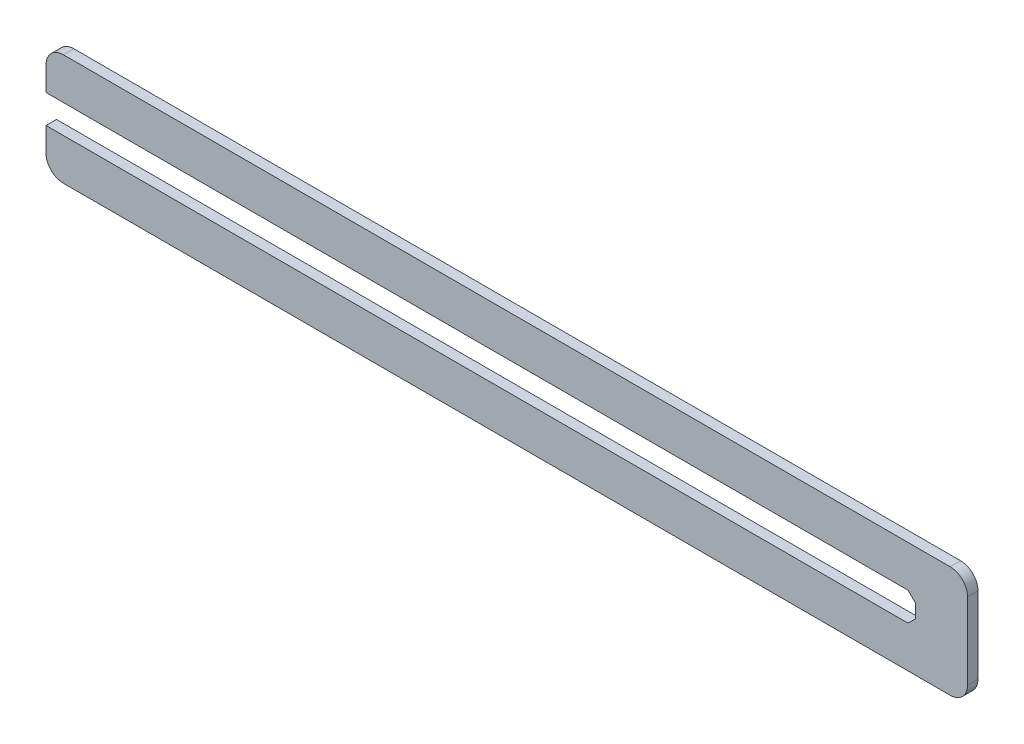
ISO-10303-21;
HEADER;
FILE_DESCRIPTION(('STEP AP214'),'2;1');
FILE_NAME('part.step','',(''),(''),'','','');
FILE_SCHEMA(('AUTOMOTIVE_DESIGN { 1 0 10303 214 1 1 1 1 }'));
ENDSEC;
DATA;
#1=APPLICATION_CONTEXT('core data for automotive mechanical design processes');
#2=APPLICATION_PROTOCOL_DEFINITION('international standard','automotive_design',2000,#1);
#3=PRODUCT_CONTEXT('',#1,'mechanical');
#4=PRODUCT('Part','Part','',(#3));
#5=PRODUCT_RELATED_PRODUCT_CATEGORY('part','',(#4));
#6=PRODUCT_DEFINITION_FORMATION('','',#4);
#7=PRODUCT_DEFINITION_CONTEXT('part definition',#1,'design');
#8=PRODUCT_DEFINITION('design','',#6,#7);
#9=PRODUCT_DEFINITION_SHAPE('','',#8);
#10=(LENGTH_UNIT() NAMED_UNIT(*) SI_UNIT(.MILLI.,.METRE.));
#11=(NAMED_UNIT(*) PLANE_ANGLE_UNIT() SI_UNIT($,.RADIAN.));
#12=(NAMED_UNIT(*) SI_UNIT($,.STERADIAN.) SOLID_ANGLE_UNIT());
#13=UNCERTAINTY_MEASURE_WITH_UNIT(LENGTH_MEASURE(1.E-05),#10,'distance_accuracy_value','');
#14=(GEOMETRIC_REPRESENTATION_CONTEXT(3) GLOBAL_UNCERTAINTY_ASSIGNED_CONTEXT((#13)) GLOBAL_UNIT_ASSIGNED_CONTEXT((#10,
#11,#12)) REPRESENTATION_CONTEXT('',''));
#15=CARTESIAN_POINT('',(0.,0.,0.));
#16=DIRECTION('',(0.,0.,1.));
#17=DIRECTION('',(1.,0.,0.));
#18=AXIS2_PLACEMENT_3D('',#15,#16,#17);
#19=CARTESIAN_POINT('',(0.,0.,3.));
#20=DIRECTION('',(1.,0.,0.));
#21=DIRECTION('',(0.,0.,-1.));
#22=AXIS2_PLACEMENT_3D('',#19,#20,#21);
#23=PLANE('',#22);
#24=DIRECTION('',(0.,-1.,0.));
#25=VECTOR('',#24,1.);
#26=CARTESIAN_POINT('',(0.,0.,3.));
#27=LINE('',#26,#25);
#28=CARTESIAN_POINT('',(0.,27.,3.));
#29=VERTEX_POINT('',#28);
#30=CARTESIAN_POINT('',(0.,20.1,3.));
#31=VERTEX_POINT('',#30);
#32=EDGE_CURVE('E224',#29,#31,#27,.T.);
#33=ORIENTED_EDGE('',*,*,#32,.F.);
#34=DIRECTION('',(0.,0.,-1.));
#35=VECTOR('',#34,1.);
#36=CARTESIAN_POINT('',(0.,27.,3.));
#37=LINE('',#36,#35);
#38=CARTESIAN_POINT('',(0.,27.,0.));
#39=VERTEX_POINT('',#38);
#40=EDGE_CURVE('E178',#29,#39,#37,.T.);
#41=ORIENTED_EDGE('',*,*,#40,.T.);
#42=DIRECTION('',(0.,-1.,0.));
#43=VECTOR('',#42,1.);
#44=CARTESIAN_POINT('',(0.,0.,0.));
#45=LINE('',#44,#43);
#46=CARTESIAN_POINT('',(0.,20.1,0.));
#47=VERTEX_POINT('',#46);
#48=EDGE_CURVE('E160',#39,#47,#45,.T.);
#49=ORIENTED_EDGE('',*,*,#48,.T.);
#50=DIRECTION('',(0.,0.,1.));
#51=VECTOR('',#50,1.);
#52=CARTESIAN_POINT('',(0.,20.1,0.));
#53=LINE('',#52,#51);
#54=EDGE_CURVE('E161',#47,#31,#53,.T.);
#55=ORIENTED_EDGE('',*,*,#54,.T.);
#56=EDGE_LOOP('',(#33,#41,#49,#55));
#57=FACE_BOUND('',#56,.T.);
#58=ADVANCED_FACE('F32',(#57),#23,.F.);
#59=CARTESIAN_POINT('',(0.,11.9,0.));
#60=VERTEX_POINT('',#59);
#61=CARTESIAN_POINT('',(0.,5.,0.));
#62=VERTEX_POINT('',#61);
#63=EDGE_CURVE('E150',#60,#62,#45,.T.);
#64=ORIENTED_EDGE('',*,*,#63,.T.);
#65=DIRECTION('',(0.,0.,-1.));
#66=VECTOR('',#65,1.);
#67=CARTESIAN_POINT('',(0.,5.,3.));
#68=LINE('',#67,#66);
#69=CARTESIAN_POINT('',(0.,5.,3.));
#70=VERTEX_POINT('',#69);
#71=EDGE_CURVE('E205',#62,#70,#68,.F.);
#72=ORIENTED_EDGE('',*,*,#71,.T.);
#73=CARTESIAN_POINT('',(0.,11.9,3.));
#74=VERTEX_POINT('',#73);
#75=EDGE_CURVE('E153',#74,#70,#27,.T.);
#76=ORIENTED_EDGE('',*,*,#75,.F.);
#77=DIRECTION('',(0.,0.,1.));
#78=VECTOR('',#77,1.);
#79=CARTESIAN_POINT('',(0.,11.9,0.));
#80=LINE('',#79,#78);
#81=EDGE_CURVE('E137',#60,#74,#80,.T.);
#82=ORIENTED_EDGE('',*,*,#81,.F.);
#83=EDGE_LOOP('',(#64,#72,#76,#82));
#84=FACE_BOUND('',#83,.T.);
#85=ADVANCED_FACE('F149',(#84),#23,.F.);
#86=CARTESIAN_POINT('',(0.,0.,3.));
#87=DIRECTION('',(0.,1.,0.));
#88=DIRECTION('',(0.,0.,1.));
#89=AXIS2_PLACEMENT_3D('',#86,#87,#88);
#90=PLANE('',#89);
#91=DIRECTION('',(1.,0.,0.));
#92=VECTOR('',#91,1.);
#93=CARTESIAN_POINT('',(0.,0.,3.));
#94=LINE('',#93,#92);
#95=CARTESIAN_POINT('',(5.,0.,3.));
#96=VERTEX_POINT('',#95);
#97=CARTESIAN_POINT('',(260.,0.,3.));
#98=VERTEX_POINT('',#97);
#99=EDGE_CURVE('E223',#96,#98,#94,.T.);
#100=ORIENTED_EDGE('',*,*,#99,.F.);
#101=DIRECTION('',(0.,0.,-1.));
#102=VECTOR('',#101,1.);
#103=CARTESIAN_POINT('',(5.,0.,3.));
#104=LINE('',#103,#102);
#105=CARTESIAN_POINT('',(5.,0.,0.));
#106=VERTEX_POINT('',#105);
#107=EDGE_CURVE('E202',#96,#106,#104,.T.);
#108=ORIENTED_EDGE('',*,*,#107,.T.);
#109=DIRECTION('',(1.,0.,0.));
#110=VECTOR('',#109,1.);
#111=CARTESIAN_POINT('',(0.,0.,0.));
#112=LINE('',#111,#110);
#113=CARTESIAN_POINT('',(260.,0.,0.));
#114=VERTEX_POINT('',#113);
#115=EDGE_CURVE('E163',#106,#114,#112,.T.);
#116=ORIENTED_EDGE('',*,*,#115,.T.);
#117=DIRECTION('',(0.,0.,-1.));
#118=VECTOR('',#117,1.);
#119=CARTESIAN_POINT('',(260.,0.,3.));
#120=LINE('',#119,#118);
#121=EDGE_CURVE('E200',#114,#98,#120,.F.);
#122=ORIENTED_EDGE('',*,*,#121,.T.);
#123=EDGE_LOOP('',(#100,#108,#116,#122));
#124=FACE_BOUND('',#123,.T.);
#125=ADVANCED_FACE('F283',(#124),#90,.F.);
#126=CARTESIAN_POINT('',(265.,0.,3.));
#127=DIRECTION('',(-1.,0.,0.));
#128=DIRECTION('',(0.,0.,1.));
#129=AXIS2_PLACEMENT_3D('',#126,#127,#128);
#130=PLANE('',#129);
#131=DIRECTION('',(0.,1.,0.));
#132=VECTOR('',#131,1.);
#133=CARTESIAN_POINT('',(265.,0.,0.));
#134=LINE('',#133,#132);
#135=CARTESIAN_POINT('',(265.,5.,0.));
#136=VERTEX_POINT('',#135);
#137=CARTESIAN_POINT('',(265.,27.,0.));
#138=VERTEX_POINT('',#137);
#139=EDGE_CURVE('E173',#136,#138,#134,.T.);
#140=ORIENTED_EDGE('',*,*,#139,.T.);
#141=DIRECTION('',(0.,0.,-1.));
#142=VECTOR('',#141,1.);
#143=CARTESIAN_POINT('',(265.,27.,3.));
#144=LINE('',#143,#142);
#145=CARTESIAN_POINT('',(265.,27.,3.));
#146=VERTEX_POINT('',#145);
#147=EDGE_CURVE('E11',#138,#146,#144,.F.);
#148=ORIENTED_EDGE('',*,*,#147,.T.);
#149=DIRECTION('',(0.,1.,0.));
#150=VECTOR('',#149,1.);
#151=CARTESIAN_POINT('',(265.,0.,3.));
#152=LINE('',#151,#150);
#153=CARTESIAN_POINT('',(265.,5.,3.));
#154=VERTEX_POINT('',#153);
#155=EDGE_CURVE('E210',#154,#146,#152,.T.);
#156=ORIENTED_EDGE('',*,*,#155,.F.);
#157=DIRECTION('',(0.,0.,-1.));
#158=VECTOR('',#157,1.);
#159=CARTESIAN_POINT('',(265.,5.,3.));
#160=LINE('',#159,#158);
#161=EDGE_CURVE('E40',#154,#136,#160,.T.);
#162=ORIENTED_EDGE('',*,*,#161,.T.);
#163=EDGE_LOOP('',(#140,#148,#156,#162));
#164=FACE_BOUND('',#163,.T.);
#165=ADVANCED_FACE('F209',(#164),#130,.F.);
#166=CARTESIAN_POINT('',(0.,32.,3.));
#167=DIRECTION('',(0.,-1.,0.));
#168=DIRECTION('',(0.,0.,-1.));
#169=AXIS2_PLACEMENT_3D('',#166,#167,#168);
#170=PLANE('',#169);
#171=DIRECTION('',(-1.,0.,0.));
#172=VECTOR('',#171,1.);
#173=CARTESIAN_POINT('',(0.,32.,0.));
#174=LINE('',#173,#172);
#175=CARTESIAN_POINT('',(260.,32.,0.));
#176=VERTEX_POINT('',#175);
#177=CARTESIAN_POINT('',(5.,32.,0.));
#178=VERTEX_POINT('',#177);
#179=EDGE_CURVE('E175',#176,#178,#174,.T.);
#180=ORIENTED_EDGE('',*,*,#179,.T.);
#181=DIRECTION('',(0.,0.,-1.));
#182=VECTOR('',#181,1.);
#183=CARTESIAN_POINT('',(5.,32.,3.));
#184=LINE('',#183,#182);
#185=CARTESIAN_POINT('',(5.,32.,3.));
#186=VERTEX_POINT('',#185);
#187=EDGE_CURVE('E191',#178,#186,#184,.F.);
#188=ORIENTED_EDGE('',*,*,#187,.T.);
#189=DIRECTION('',(-1.,0.,0.));
#190=VECTOR('',#189,1.);
#191=CARTESIAN_POINT('',(0.,32.,3.));
#192=LINE('',#191,#190);
#193=CARTESIAN_POINT('',(260.,32.,3.));
#194=VERTEX_POINT('',#193);
#195=EDGE_CURVE('E169',#194,#186,#192,.T.);
#196=ORIENTED_EDGE('',*,*,#195,.F.);
#197=DIRECTION('',(0.,0.,-1.));
#198=VECTOR('',#197,1.);
#199=CARTESIAN_POINT('',(260.,32.,3.));
#200=LINE('',#199,#198);
#201=EDGE_CURVE('E188',#194,#176,#200,.T.);
#202=ORIENTED_EDGE('',*,*,#201,.T.);
#203=EDGE_LOOP('',(#180,#188,#196,#202));
#204=FACE_BOUND('',#203,.T.);
#205=ADVANCED_FACE('F219',(#204),#170,.F.);
#206=CARTESIAN_POINT('',(0.,32.,3.));
#207=DIRECTION('',(0.,0.,-1.));
#208=DIRECTION('',(-1.,0.,0.));
#209=AXIS2_PLACEMENT_3D('',#206,#207,#208);
#210=PLANE('',#209);
#211=ORIENTED_EDGE('',*,*,#195,.T.);
#212=CARTESIAN_POINT('',(5.,27.,3.));
#213=DIRECTION('',(0.,0.,-1.));
#214=DIRECTION('',(-1.,0.,0.));
#215=AXIS2_PLACEMENT_3D('',#212,#213,#214);
#216=CIRCLE('',#215,5.);
#217=EDGE_CURVE('E198',#186,#29,#216,.F.);
#218=ORIENTED_EDGE('',*,*,#217,.T.);
#219=ORIENTED_EDGE('',*,*,#32,.T.);
#220=DIRECTION('',(-1.,0.,0.));
#221=VECTOR('',#220,1.);
#222=CARTESIAN_POINT('',(0.,20.1,3.));
#223=LINE('',#222,#221);
#224=CARTESIAN_POINT('',(247.87867965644,20.1,3.));
#225=VERTEX_POINT('',#224);
#226=EDGE_CURVE('E144',#225,#31,#223,.T.);
#227=ORIENTED_EDGE('',*,*,#226,.F.);
#228=DIRECTION('',(-0.707106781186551,0.707106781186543,0.));
#229=VECTOR('',#228,1.);
#230=CARTESIAN_POINT('',(247.87867965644,20.1,3.));
#231=LINE('',#230,#229);
#232=CARTESIAN_POINT('',(250.,17.9786796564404,3.));
#233=VERTEX_POINT('',#232);
#234=EDGE_CURVE('E236',#233,#225,#231,.T.);
#235=ORIENTED_EDGE('',*,*,#234,.F.);
#236=DIRECTION('',(0.,1.,0.));
#237=VECTOR('',#236,1.);
#238=CARTESIAN_POINT('',(250.,17.9786796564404,3.));
#239=LINE('',#238,#237);
#240=CARTESIAN_POINT('',(250.,14.0213203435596,3.));
#241=VERTEX_POINT('',#240);
#242=EDGE_CURVE('E239',#241,#233,#239,.T.);
#243=ORIENTED_EDGE('',*,*,#242,.F.);
#244=DIRECTION('',(0.707106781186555,0.70710678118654,0.));
#245=VECTOR('',#244,1.);
#246=CARTESIAN_POINT('',(250.,14.0213203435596,3.));
#247=LINE('',#246,#245);
#248=CARTESIAN_POINT('',(247.87867965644,11.9,3.));
#249=VERTEX_POINT('',#248);
#250=EDGE_CURVE('E242',#249,#241,#247,.T.);
#251=ORIENTED_EDGE('',*,*,#250,.F.);
#252=DIRECTION('',(1.,0.,0.));
#253=VECTOR('',#252,1.);
#254=CARTESIAN_POINT('',(0.,11.9,3.));
#255=LINE('',#254,#253);
#256=EDGE_CURVE('E245',#74,#249,#255,.T.);
#257=ORIENTED_EDGE('',*,*,#256,.F.);
#258=ORIENTED_EDGE('',*,*,#75,.T.);
#259=CARTESIAN_POINT('',(5.,5.,3.));
#260=DIRECTION('',(0.,0.,-1.));
#261=DIRECTION('',(-1.,0.,0.));
#262=AXIS2_PLACEMENT_3D('',#259,#260,#261);
#263=CIRCLE('',#262,5.);
#264=EDGE_CURVE('E196',#70,#96,#263,.F.);
#265=ORIENTED_EDGE('',*,*,#264,.T.);
#266=ORIENTED_EDGE('',*,*,#99,.T.);
#267=CARTESIAN_POINT('',(260.,5.,3.));
#268=DIRECTION('',(0.,0.,-1.));
#269=DIRECTION('',(-1.,0.,0.));
#270=AXIS2_PLACEMENT_3D('',#267,#268,#269);
#271=CIRCLE('',#270,5.);
#272=EDGE_CURVE('E52',#98,#154,#271,.F.);
#273=ORIENTED_EDGE('',*,*,#272,.T.);
#274=ORIENTED_EDGE('',*,*,#155,.T.);
#275=CARTESIAN_POINT('',(260.,27.,3.));
#276=DIRECTION('',(0.,0.,-1.));
#277=DIRECTION('',(-1.,0.,0.));
#278=AXIS2_PLACEMENT_3D('',#275,#276,#277);
#279=CIRCLE('',#278,5.);
#280=EDGE_CURVE('E194',#146,#194,#279,.F.);
#281=ORIENTED_EDGE('',*,*,#280,.T.);
#282=EDGE_LOOP('',(#211,#218,#219,#227,#235,#243,#251,#257,#258,#265,#266,#273,#274,#281));
#283=FACE_BOUND('',#282,.T.);
#284=ADVANCED_FACE('F276',(#283),#210,.F.);
#285=CARTESIAN_POINT('',(0.,32.,0.));
#286=DIRECTION('',(0.,0.,-1.));
#287=DIRECTION('',(-1.,0.,0.));
#288=AXIS2_PLACEMENT_3D('',#285,#286,#287);
#289=PLANE('',#288);
#290=ORIENTED_EDGE('',*,*,#48,.F.);
#291=CARTESIAN_POINT('',(5.,27.,0.));
#292=DIRECTION('',(0.,0.,-1.));
#293=DIRECTION('',(-1.,0.,0.));
#294=AXIS2_PLACEMENT_3D('',#291,#292,#293);
#295=CIRCLE('',#294,5.);
#296=EDGE_CURVE('E186',#39,#178,#295,.T.);
#297=ORIENTED_EDGE('',*,*,#296,.T.);
#298=ORIENTED_EDGE('',*,*,#179,.F.);
#299=CARTESIAN_POINT('',(260.,27.,0.));
#300=DIRECTION('',(0.,0.,-1.));
#301=DIRECTION('',(-1.,0.,0.));
#302=AXIS2_PLACEMENT_3D('',#299,#300,#301);
#303=CIRCLE('',#302,5.);
#304=EDGE_CURVE('E183',#176,#138,#303,.T.);
#305=ORIENTED_EDGE('',*,*,#304,.T.);
#306=ORIENTED_EDGE('',*,*,#139,.F.);
#307=CARTESIAN_POINT('',(260.,5.,0.));
#308=DIRECTION('',(0.,0.,-1.));
#309=DIRECTION('',(-1.,0.,0.));
#310=AXIS2_PLACEMENT_3D('',#307,#308,#309);
#311=CIRCLE('',#310,5.);
#312=EDGE_CURVE('E181',#136,#114,#311,.T.);
#313=ORIENTED_EDGE('',*,*,#312,.T.);
#314=ORIENTED_EDGE('',*,*,#115,.F.);
#315=CARTESIAN_POINT('',(5.,5.,0.));
#316=DIRECTION('',(0.,0.,-1.));
#317=DIRECTION('',(-1.,0.,0.));
#318=AXIS2_PLACEMENT_3D('',#315,#316,#317);
#319=CIRCLE('',#318,5.);
#320=EDGE_CURVE('E159',#106,#62,#319,.T.);
#321=ORIENTED_EDGE('',*,*,#320,.T.);
#322=ORIENTED_EDGE('',*,*,#63,.F.);
#323=DIRECTION('',(1.,0.,0.));
#324=VECTOR('',#323,1.);
#325=CARTESIAN_POINT('',(0.,11.9,0.));
#326=LINE('',#325,#324);
#327=CARTESIAN_POINT('',(247.87867965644,11.9,0.));
#328=VERTEX_POINT('',#327);
#329=EDGE_CURVE('E133',#60,#328,#326,.T.);
#330=ORIENTED_EDGE('',*,*,#329,.T.);
#331=DIRECTION('',(0.707106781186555,0.70710678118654,0.));
#332=VECTOR('',#331,1.);
#333=CARTESIAN_POINT('',(250.,14.0213203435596,0.));
#334=LINE('',#333,#332);
#335=CARTESIAN_POINT('',(250.,14.0213203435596,0.));
#336=VERTEX_POINT('',#335);
#337=EDGE_CURVE('E143',#328,#336,#334,.T.);
#338=ORIENTED_EDGE('',*,*,#337,.T.);
#339=DIRECTION('',(0.,1.,0.));
#340=VECTOR('',#339,1.);
#341=CARTESIAN_POINT('',(250.,17.9786796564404,0.));
#342=LINE('',#341,#340);
#343=CARTESIAN_POINT('',(250.,17.9786796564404,0.));
#344=VERTEX_POINT('',#343);
#345=EDGE_CURVE('E252',#336,#344,#342,.T.);
#346=ORIENTED_EDGE('',*,*,#345,.T.);
#347=DIRECTION('',(-0.707106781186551,0.707106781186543,0.));
#348=VECTOR('',#347,1.);
#349=CARTESIAN_POINT('',(247.87867965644,20.1,0.));
#350=LINE('',#349,#348);
#351=CARTESIAN_POINT('',(247.87867965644,20.1,0.));
#352=VERTEX_POINT('',#351);
#353=EDGE_CURVE('E249',#344,#352,#350,.T.);
#354=ORIENTED_EDGE('',*,*,#353,.T.);
#355=DIRECTION('',(-1.,0.,0.));
#356=VECTOR('',#355,1.);
#357=CARTESIAN_POINT('',(0.,20.1,0.));
#358=LINE('',#357,#356);
#359=EDGE_CURVE('E154',#352,#47,#358,.T.);
#360=ORIENTED_EDGE('',*,*,#359,.T.);
#361=EDGE_LOOP('',(#290,#297,#298,#305,#306,#313,#314,#321,#322,#330,#338,#346,#354,#360));
#362=FACE_BOUND('',#361,.T.);
#363=ADVANCED_FACE('F157',(#362),#289,.T.);
#364=CARTESIAN_POINT('',(0.,20.1,0.));
#365=DIRECTION('',(0.,1.,0.));
#366=DIRECTION('',(0.,0.,1.));
#367=AXIS2_PLACEMENT_3D('',#364,#365,#366);
#368=PLANE('',#367);
#369=ORIENTED_EDGE('',*,*,#226,.T.);
#370=ORIENTED_EDGE('',*,*,#54,.F.);
#371=ORIENTED_EDGE('',*,*,#359,.F.);
#372=DIRECTION('',(0.,0.,1.));
#373=VECTOR('',#372,1.);
#374=CARTESIAN_POINT('',(247.87867965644,20.1,0.));
#375=LINE('',#374,#373);
#376=EDGE_CURVE('E165',#352,#225,#375,.T.);
#377=ORIENTED_EDGE('',*,*,#376,.T.);
#378=EDGE_LOOP('',(#369,#370,#371,#377));
#379=FACE_BOUND('',#378,.T.);
#380=ADVANCED_FACE('F269',(#379),#368,.F.);
#381=CARTESIAN_POINT('',(247.87867965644,20.1,0.));
#382=DIRECTION('',(0.707106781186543,0.707106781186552,0.));
#383=DIRECTION('',(-0.707106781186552,0.707106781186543,0.));
#384=AXIS2_PLACEMENT_3D('',#381,#382,#383);
#385=PLANE('',#384);
#386=ORIENTED_EDGE('',*,*,#234,.T.);
#387=ORIENTED_EDGE('',*,*,#376,.F.);
#388=ORIENTED_EDGE('',*,*,#353,.F.);
#389=DIRECTION('',(0.,0.,1.));
#390=VECTOR('',#389,1.);
#391=CARTESIAN_POINT('',(250.,17.9786796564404,0.));
#392=LINE('',#391,#390);
#393=EDGE_CURVE('E231',#344,#233,#392,.T.);
#394=ORIENTED_EDGE('',*,*,#393,.T.);
#395=EDGE_LOOP('',(#386,#387,#388,#394));
#396=FACE_BOUND('',#395,.T.);
#397=ADVANCED_FACE('F265',(#396),#385,.F.);
#398=CARTESIAN_POINT('',(250.,17.9786796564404,0.));
#399=DIRECTION('',(1.,0.,0.));
#400=DIRECTION('',(0.,0.,-1.));
#401=AXIS2_PLACEMENT_3D('',#398,#399,#400);
#402=PLANE('',#401);
#403=ORIENTED_EDGE('',*,*,#242,.T.);
#404=ORIENTED_EDGE('',*,*,#393,.F.);
#405=ORIENTED_EDGE('',*,*,#345,.F.);
#406=DIRECTION('',(0.,0.,1.));
#407=VECTOR('',#406,1.);
#408=CARTESIAN_POINT('',(250.,14.0213203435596,0.));
#409=LINE('',#408,#407);
#410=EDGE_CURVE('E229',#336,#241,#409,.T.);
#411=ORIENTED_EDGE('',*,*,#410,.T.);
#412=EDGE_LOOP('',(#403,#404,#405,#411));
#413=FACE_BOUND('',#412,.T.);
#414=ADVANCED_FACE('F261',(#413),#402,.F.);
#415=CARTESIAN_POINT('',(250.,14.0213203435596,0.));
#416=DIRECTION('',(0.70710678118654,-0.707106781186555,0.));
#417=DIRECTION('',(0.707106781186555,0.70710678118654,0.));
#418=AXIS2_PLACEMENT_3D('',#415,#416,#417);
#419=PLANE('',#418);
#420=ORIENTED_EDGE('',*,*,#250,.T.);
#421=ORIENTED_EDGE('',*,*,#410,.F.);
#422=ORIENTED_EDGE('',*,*,#337,.F.);
#423=DIRECTION('',(0.,0.,1.));
#424=VECTOR('',#423,1.);
#425=CARTESIAN_POINT('',(247.87867965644,11.9,0.));
#426=LINE('',#425,#424);
#427=EDGE_CURVE('E139',#328,#249,#426,.T.);
#428=ORIENTED_EDGE('',*,*,#427,.T.);
#429=EDGE_LOOP('',(#420,#421,#422,#428));
#430=FACE_BOUND('',#429,.T.);
#431=ADVANCED_FACE('F257',(#430),#419,.F.);
#432=CARTESIAN_POINT('',(0.,11.9,0.));
#433=DIRECTION('',(0.,-1.,0.));
#434=DIRECTION('',(1.,0.,0.));
#435=AXIS2_PLACEMENT_3D('',#432,#433,#434);
#436=PLANE('',#435);
#437=ORIENTED_EDGE('',*,*,#256,.T.);
#438=ORIENTED_EDGE('',*,*,#427,.F.);
#439=ORIENTED_EDGE('',*,*,#329,.F.);
#440=ORIENTED_EDGE('',*,*,#81,.T.);
#441=EDGE_LOOP('',(#437,#438,#439,#440));
#442=FACE_BOUND('',#441,.T.);
#443=ADVANCED_FACE('F136',(#442),#436,.F.);
#444=CARTESIAN_POINT('',(5.,27.,3.));
#445=DIRECTION('',(0.,0.,-1.));
#446=DIRECTION('',(-1.,0.,0.));
#447=AXIS2_PLACEMENT_3D('',#444,#445,#446);
#448=CYLINDRICAL_SURFACE('',#447,5.);
#449=ORIENTED_EDGE('',*,*,#217,.F.);
#450=ORIENTED_EDGE('',*,*,#187,.F.);
#451=ORIENTED_EDGE('',*,*,#296,.F.);
#452=ORIENTED_EDGE('',*,*,#40,.F.);
#453=EDGE_LOOP('',(#449,#450,#451,#452));
#454=FACE_BOUND('',#453,.T.);
#455=ADVANCED_FACE('F275',(#454),#448,.T.);
#456=CARTESIAN_POINT('',(5.,5.,3.));
#457=DIRECTION('',(0.,0.,-1.));
#458=DIRECTION('',(-1.,0.,0.));
#459=AXIS2_PLACEMENT_3D('',#456,#457,#458);
#460=CYLINDRICAL_SURFACE('',#459,5.);
#461=ORIENTED_EDGE('',*,*,#264,.F.);
#462=ORIENTED_EDGE('',*,*,#71,.F.);
#463=ORIENTED_EDGE('',*,*,#320,.F.);
#464=ORIENTED_EDGE('',*,*,#107,.F.);
#465=EDGE_LOOP('',(#461,#462,#463,#464));
#466=FACE_BOUND('',#465,.T.);
#467=ADVANCED_FACE('F281',(#466),#460,.T.);
#468=CARTESIAN_POINT('',(260.,27.,3.));
#469=DIRECTION('',(0.,0.,-1.));
#470=DIRECTION('',(-1.,0.,0.));
#471=AXIS2_PLACEMENT_3D('',#468,#469,#470);
#472=CYLINDRICAL_SURFACE('',#471,5.);
#473=ORIENTED_EDGE('',*,*,#280,.F.);
#474=ORIENTED_EDGE('',*,*,#147,.F.);
#475=ORIENTED_EDGE('',*,*,#304,.F.);
#476=ORIENTED_EDGE('',*,*,#201,.F.);
#477=EDGE_LOOP('',(#473,#474,#475,#476));
#478=FACE_BOUND('',#477,.T.);
#479=ADVANCED_FACE('F216',(#478),#472,.T.);
#480=CARTESIAN_POINT('',(260.,5.,3.));
#481=DIRECTION('',(0.,0.,-1.));
#482=DIRECTION('',(-1.,0.,0.));
#483=AXIS2_PLACEMENT_3D('',#480,#481,#482);
#484=CYLINDRICAL_SURFACE('',#483,5.);
#485=ORIENTED_EDGE('',*,*,#272,.F.);
#486=ORIENTED_EDGE('',*,*,#121,.F.);
#487=ORIENTED_EDGE('',*,*,#312,.F.);
#488=ORIENTED_EDGE('',*,*,#161,.F.);
#489=EDGE_LOOP('',(#485,#486,#487,#488));
#490=FACE_BOUND('',#489,.T.);
#491=ADVANCED_FACE('F34',(#490),#484,.T.);
#492=CLOSED_SHELL('',(#58,#85,#125,#165,#205,#284,#363,#380,#397,#414,#431,#443,#455,#467,#479,#491));
#493=MANIFOLD_SOLID_BREP('B2',#492);
#494=ADVANCED_BREP_SHAPE_REPRESENTATION('',(#18,#493),#14);
#495=SHAPE_DEFINITION_REPRESENTATION(#9,#494);
ENDSEC;
END-ISO-10303-21;
